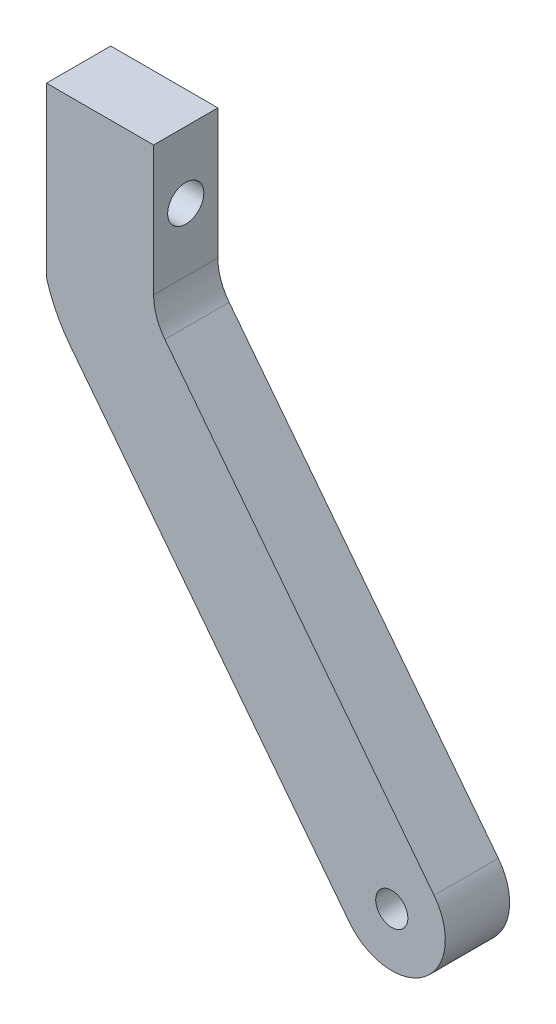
ISO-10303-21;
HEADER;
FILE_DESCRIPTION(('STEP AP214'),'2;1');
FILE_NAME('part.step','',(''),(''),'','','');
FILE_SCHEMA(('AUTOMOTIVE_DESIGN { 1 0 10303 214 1 1 1 1 }'));
ENDSEC;
DATA;
#1=APPLICATION_CONTEXT('core data for automotive mechanical design processes');
#2=APPLICATION_PROTOCOL_DEFINITION('international standard','automotive_design',2000,#1);
#3=PRODUCT_CONTEXT('',#1,'mechanical');
#4=PRODUCT('Part','Part','',(#3));
#5=PRODUCT_RELATED_PRODUCT_CATEGORY('part','',(#4));
#6=PRODUCT_DEFINITION_FORMATION('','',#4);
#7=PRODUCT_DEFINITION_CONTEXT('part definition',#1,'design');
#8=PRODUCT_DEFINITION('design','',#6,#7);
#9=PRODUCT_DEFINITION_SHAPE('','',#8);
#10=(LENGTH_UNIT() NAMED_UNIT(*) SI_UNIT(.MILLI.,.METRE.));
#11=(NAMED_UNIT(*) PLANE_ANGLE_UNIT() SI_UNIT($,.RADIAN.));
#12=(NAMED_UNIT(*) SI_UNIT($,.STERADIAN.) SOLID_ANGLE_UNIT());
#13=UNCERTAINTY_MEASURE_WITH_UNIT(LENGTH_MEASURE(1.E-05),#10,'distance_accuracy_value','');
#14=(GEOMETRIC_REPRESENTATION_CONTEXT(3) GLOBAL_UNCERTAINTY_ASSIGNED_CONTEXT((#13)) GLOBAL_UNIT_ASSIGNED_CONTEXT((#10,
#11,#12)) REPRESENTATION_CONTEXT('',''));
#15=CARTESIAN_POINT('',(0.,0.,0.));
#16=DIRECTION('',(0.,0.,1.));
#17=DIRECTION('',(1.,0.,0.));
#18=AXIS2_PLACEMENT_3D('',#15,#16,#17);
#19=CARTESIAN_POINT('',(26.2384193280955,-11.8199999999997,-6.));
#20=DIRECTION('',(0.,0.,1.));
#21=DIRECTION('',(1.,0.,0.));
#22=AXIS2_PLACEMENT_3D('',#19,#20,#21);
#23=CYLINDRICAL_SURFACE('',#22,26.2384193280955);
#24=CARTESIAN_POINT('',(26.2384193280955,-11.82,6.));
#25=DIRECTION('',(0.,0.,1.));
#26=DIRECTION('',(1.,0.,0.));
#27=AXIS2_PLACEMENT_3D('',#24,#25,#26);
#28=CIRCLE('',#27,26.2384193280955);
#29=CARTESIAN_POINT('',(1.,-18.9947361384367,5.99999999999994));
#30=VERTEX_POINT('',#29);
#31=CARTESIAN_POINT('',(5.51044309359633,-27.9074376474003,6.));
#32=VERTEX_POINT('',#31);
#33=EDGE_CURVE('E116',#30,#32,#28,.T.);
#34=ORIENTED_EDGE('',*,*,#33,.F.);
#35=DIRECTION('',(0.,0.,1.));
#36=VECTOR('',#35,1.);
#37=CARTESIAN_POINT('',(1.,-18.9947361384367,-6.00000000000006));
#38=LINE('',#37,#36);
#39=CARTESIAN_POINT('',(1.,-18.9947361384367,-6.00000000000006));
#40=VERTEX_POINT('',#39);
#41=EDGE_CURVE('E45',#40,#30,#38,.T.);
#42=ORIENTED_EDGE('',*,*,#41,.F.);
#43=CARTESIAN_POINT('',(26.2384193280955,-11.8199999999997,-6.));
#44=DIRECTION('',(0.,0.,1.));
#45=DIRECTION('',(1.,0.,0.));
#46=AXIS2_PLACEMENT_3D('',#43,#44,#45);
#47=CIRCLE('',#46,26.2384193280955);
#48=CARTESIAN_POINT('',(5.51044309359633,-27.9074376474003,-6.));
#49=VERTEX_POINT('',#48);
#50=EDGE_CURVE('E135',#40,#49,#47,.T.);
#51=ORIENTED_EDGE('',*,*,#50,.T.);
#52=DIRECTION('',(0.,0.,1.));
#53=VECTOR('',#52,1.);
#54=CARTESIAN_POINT('',(5.51044309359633,-27.9074376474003,-6.));
#55=LINE('',#54,#53);
#56=EDGE_CURVE('E144',#49,#32,#55,.T.);
#57=ORIENTED_EDGE('',*,*,#56,.T.);
#58=EDGE_LOOP('',(#34,#42,#51,#57));
#59=FACE_BOUND('',#58,.T.);
#60=ADVANCED_FACE('F28',(#59),#23,.T.);
#61=CARTESIAN_POINT('',(31.,-11.8199999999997,-6.));
#62=DIRECTION('',(0.,0.,1.));
#63=DIRECTION('',(1.,0.,0.));
#64=AXIS2_PLACEMENT_3D('',#61,#62,#63);
#65=CYLINDRICAL_SURFACE('',#64,10.);
#66=DIRECTION('',(0.,0.,1.));
#67=VECTOR('',#66,1.);
#68=CARTESIAN_POINT('',(23.100142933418,-17.9512525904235,-6.));
#69=LINE('',#68,#67);
#70=CARTESIAN_POINT('',(23.100142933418,-17.9512525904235,-6.));
#71=VERTEX_POINT('',#70);
#72=CARTESIAN_POINT('',(23.100142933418,-17.9512525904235,5.99999999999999));
#73=VERTEX_POINT('',#72);
#74=EDGE_CURVE('E11',#71,#73,#69,.T.);
#75=ORIENTED_EDGE('',*,*,#74,.F.);
#76=CARTESIAN_POINT('',(31.,-11.8199999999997,-6.));
#77=DIRECTION('',(0.,0.,1.));
#78=DIRECTION('',(1.,0.,0.));
#79=AXIS2_PLACEMENT_3D('',#76,#77,#78);
#80=CIRCLE('',#79,10.);
#81=CARTESIAN_POINT('',(21.,-11.82,-6.));
#82=VERTEX_POINT('',#81);
#83=EDGE_CURVE('E118',#82,#71,#80,.T.);
#84=ORIENTED_EDGE('',*,*,#83,.F.);
#85=DIRECTION('',(0.,0.,1.));
#86=VECTOR('',#85,1.);
#87=CARTESIAN_POINT('',(21.,-11.82,-6.));
#88=LINE('',#87,#86);
#89=CARTESIAN_POINT('',(21.,-11.82,6.));
#90=VERTEX_POINT('',#89);
#91=EDGE_CURVE('E53',#82,#90,#88,.T.);
#92=ORIENTED_EDGE('',*,*,#91,.T.);
#93=CARTESIAN_POINT('',(31.,-11.82,6.));
#94=DIRECTION('',(0.,0.,1.));
#95=DIRECTION('',(1.,0.,0.));
#96=AXIS2_PLACEMENT_3D('',#93,#94,#95);
#97=CIRCLE('',#96,10.);
#98=EDGE_CURVE('E208',#90,#73,#97,.T.);
#99=ORIENTED_EDGE('',*,*,#98,.T.);
#100=EDGE_LOOP('',(#75,#84,#92,#99));
#101=FACE_BOUND('',#100,.T.);
#102=ADVANCED_FACE('F170',(#101),#65,.F.);
#103=CARTESIAN_POINT('',(73.359857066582,-82.708747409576,-6.));
#104=DIRECTION('',(0.789985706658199,0.613125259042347,0.));
#105=DIRECTION('',(-0.613125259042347,0.789985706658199,0.));
#106=AXIS2_PLACEMENT_3D('',#103,#104,#105);
#107=PLANE('',#106);
#108=DIRECTION('',(0.,0.,1.));
#109=VECTOR('',#108,1.);
#110=CARTESIAN_POINT('',(73.359857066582,-82.708747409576,-6.));
#111=LINE('',#110,#109);
#112=CARTESIAN_POINT('',(73.359857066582,-82.708747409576,-6.));
#113=VERTEX_POINT('',#112);
#114=CARTESIAN_POINT('',(73.359857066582,-82.7087474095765,5.99999999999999));
#115=VERTEX_POINT('',#114);
#116=EDGE_CURVE('E37',#113,#115,#111,.T.);
#117=ORIENTED_EDGE('',*,*,#116,.F.);
#118=DIRECTION('',(-0.613125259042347,0.789985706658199,0.));
#119=VECTOR('',#118,1.);
#120=CARTESIAN_POINT('',(73.359857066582,-82.708747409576,-6.));
#121=LINE('',#120,#119);
#122=EDGE_CURVE('E126',#113,#71,#121,.T.);
#123=ORIENTED_EDGE('',*,*,#122,.T.);
#124=ORIENTED_EDGE('',*,*,#74,.T.);
#125=DIRECTION('',(-0.613125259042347,0.789985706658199,0.));
#126=VECTOR('',#125,1.);
#127=CARTESIAN_POINT('',(73.359857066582,-82.7087474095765,5.99999999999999));
#128=LINE('',#127,#126);
#129=EDGE_CURVE('E211',#115,#73,#128,.T.);
#130=ORIENTED_EDGE('',*,*,#129,.F.);
#131=EDGE_LOOP('',(#117,#123,#124,#130));
#132=FACE_BOUND('',#131,.T.);
#133=ADVANCED_FACE('F30',(#132),#107,.T.);
#134=CARTESIAN_POINT('',(65.46,-88.84,-6.));
#135=DIRECTION('',(0.,0.,1.));
#136=DIRECTION('',(1.,0.,0.));
#137=AXIS2_PLACEMENT_3D('',#134,#135,#136);
#138=CYLINDRICAL_SURFACE('',#137,10.);
#139=DIRECTION('',(0.,0.,1.));
#140=VECTOR('',#139,1.);
#141=CARTESIAN_POINT('',(57.560142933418,-94.9712525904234,-6.00000000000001));
#142=LINE('',#141,#140);
#143=CARTESIAN_POINT('',(57.560142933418,-94.9712525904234,-6.00000000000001));
#144=VERTEX_POINT('',#143);
#145=CARTESIAN_POINT('',(57.560142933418,-94.9712525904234,6.));
#146=VERTEX_POINT('',#145);
#147=EDGE_CURVE('E147',#144,#146,#142,.T.);
#148=ORIENTED_EDGE('',*,*,#147,.F.);
#149=CARTESIAN_POINT('',(65.46,-88.84,-6.));
#150=DIRECTION('',(0.,0.,1.));
#151=DIRECTION('',(1.,0.,0.));
#152=AXIS2_PLACEMENT_3D('',#149,#150,#151);
#153=CIRCLE('',#152,10.);
#154=EDGE_CURVE('E129',#144,#113,#153,.T.);
#155=ORIENTED_EDGE('',*,*,#154,.T.);
#156=ORIENTED_EDGE('',*,*,#116,.T.);
#157=CARTESIAN_POINT('',(65.46,-88.84,6.));
#158=DIRECTION('',(0.,0.,1.));
#159=DIRECTION('',(1.,0.,0.));
#160=AXIS2_PLACEMENT_3D('',#157,#158,#159);
#161=CIRCLE('',#160,10.);
#162=EDGE_CURVE('E194',#146,#115,#161,.T.);
#163=ORIENTED_EDGE('',*,*,#162,.F.);
#164=EDGE_LOOP('',(#148,#155,#156,#163));
#165=FACE_BOUND('',#164,.T.);
#166=ADVANCED_FACE('F183',(#165),#138,.T.);
#167=CARTESIAN_POINT('',(57.560142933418,-94.9712525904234,-6.00000000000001));
#168=DIRECTION('',(0.7899857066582,0.613125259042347,0.));
#169=DIRECTION('',(-0.613125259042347,0.7899857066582,0.));
#170=AXIS2_PLACEMENT_3D('',#167,#168,#169);
#171=PLANE('',#170);
#172=ORIENTED_EDGE('',*,*,#56,.F.);
#173=DIRECTION('',(-0.613125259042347,0.7899857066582,0.));
#174=VECTOR('',#173,1.);
#175=CARTESIAN_POINT('',(57.560142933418,-94.9712525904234,-6.00000000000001));
#176=LINE('',#175,#174);
#177=EDGE_CURVE('E132',#144,#49,#176,.T.);
#178=ORIENTED_EDGE('',*,*,#177,.F.);
#179=ORIENTED_EDGE('',*,*,#147,.T.);
#180=DIRECTION('',(-0.613125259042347,0.7899857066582,0.));
#181=VECTOR('',#180,1.);
#182=CARTESIAN_POINT('',(57.560142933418,-94.9712525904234,6.));
#183=LINE('',#182,#181);
#184=EDGE_CURVE('E120',#146,#32,#183,.T.);
#185=ORIENTED_EDGE('',*,*,#184,.T.);
#186=EDGE_LOOP('',(#172,#178,#179,#185));
#187=FACE_BOUND('',#186,.T.);
#188=ADVANCED_FACE('F181',(#187),#171,.F.);
#189=CARTESIAN_POINT('',(0.,12.4300000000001,-6.));
#190=DIRECTION('',(0.,-1.,0.));
#191=DIRECTION('',(1.,0.,0.));
#192=AXIS2_PLACEMENT_3D('',#189,#190,#191);
#193=PLANE('',#192);
#194=DIRECTION('',(1.,0.,0.));
#195=VECTOR('',#194,1.);
#196=CARTESIAN_POINT('',(0.,12.4300000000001,-6.));
#197=LINE('',#196,#195);
#198=CARTESIAN_POINT('',(1.,12.4300000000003,-6.));
#199=VERTEX_POINT('',#198);
#200=CARTESIAN_POINT('',(21.,12.4300000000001,-6.));
#201=VERTEX_POINT('',#200);
#202=EDGE_CURVE('E109',#199,#201,#197,.T.);
#203=ORIENTED_EDGE('',*,*,#202,.F.);
#204=DIRECTION('',(0.,0.,1.));
#205=VECTOR('',#204,1.);
#206=CARTESIAN_POINT('',(1.,12.4300000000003,-6.));
#207=LINE('',#206,#205);
#208=CARTESIAN_POINT('',(1.,12.4300000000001,6.));
#209=VERTEX_POINT('',#208);
#210=EDGE_CURVE('E96',#199,#209,#207,.T.);
#211=ORIENTED_EDGE('',*,*,#210,.T.);
#212=DIRECTION('',(1.,0.,0.));
#213=VECTOR('',#212,1.);
#214=CARTESIAN_POINT('',(0.,12.4300000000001,6.));
#215=LINE('',#214,#213);
#216=CARTESIAN_POINT('',(21.,12.4300000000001,6.));
#217=VERTEX_POINT('',#216);
#218=EDGE_CURVE('E107',#209,#217,#215,.T.);
#219=ORIENTED_EDGE('',*,*,#218,.T.);
#220=DIRECTION('',(0.,0.,1.));
#221=VECTOR('',#220,1.);
#222=CARTESIAN_POINT('',(21.,12.4300000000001,-6.));
#223=LINE('',#222,#221);
#224=EDGE_CURVE('E142',#201,#217,#223,.T.);
#225=ORIENTED_EDGE('',*,*,#224,.F.);
#226=EDGE_LOOP('',(#203,#211,#219,#225));
#227=FACE_BOUND('',#226,.T.);
#228=ADVANCED_FACE('F105',(#227),#193,.F.);
#229=CARTESIAN_POINT('',(21.,12.4300000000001,-6.));
#230=DIRECTION('',(-1.,0.,0.));
#231=DIRECTION('',(0.,0.,1.));
#232=AXIS2_PLACEMENT_3D('',#229,#230,#231);
#233=PLANE('',#232);
#234=CARTESIAN_POINT('',(21.,2.63677968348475E-13,0.));
#235=DIRECTION('',(-1.,0.,0.));
#236=DIRECTION('',(0.,0.,1.));
#237=AXIS2_PLACEMENT_3D('',#234,#235,#236);
#238=CIRCLE('',#237,3.375);
#239=CARTESIAN_POINT('',(21.,2.63677968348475E-13,3.375));
#240=VERTEX_POINT('',#239);
#241=EDGE_CURVE('E149',#240,#240,#238,.T.);
#242=ORIENTED_EDGE('',*,*,#241,.T.);
#243=EDGE_LOOP('',(#242));
#244=FACE_BOUND('',#243,.T.);
#245=DIRECTION('',(0.,-1.,0.));
#246=VECTOR('',#245,1.);
#247=CARTESIAN_POINT('',(21.,12.4300000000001,-6.));
#248=LINE('',#247,#246);
#249=EDGE_CURVE('E138',#201,#82,#248,.T.);
#250=ORIENTED_EDGE('',*,*,#249,.F.);
#251=ORIENTED_EDGE('',*,*,#224,.T.);
#252=DIRECTION('',(0.,-1.,0.));
#253=VECTOR('',#252,1.);
#254=CARTESIAN_POINT('',(21.,12.4300000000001,6.));
#255=LINE('',#254,#253);
#256=EDGE_CURVE('E115',#217,#90,#255,.T.);
#257=ORIENTED_EDGE('',*,*,#256,.T.);
#258=ORIENTED_EDGE('',*,*,#91,.F.);
#259=EDGE_LOOP('',(#250,#251,#257,#258));
#260=FACE_BOUND('',#259,.T.);
#261=ADVANCED_FACE('F215',(#244,#260),#233,.F.);
#262=CARTESIAN_POINT('',(31.,-11.8199999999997,-6.));
#263=DIRECTION('',(0.,0.,1.));
#264=DIRECTION('',(1.,0.,0.));
#265=AXIS2_PLACEMENT_3D('',#262,#263,#264);
#266=PLANE('',#265);
#267=CARTESIAN_POINT('',(65.46,-88.84,-6.));
#268=DIRECTION('',(0.,0.,1.));
#269=DIRECTION('',(1.,0.,0.));
#270=AXIS2_PLACEMENT_3D('',#267,#268,#269);
#271=CIRCLE('',#270,3.00000000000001);
#272=CARTESIAN_POINT('',(68.46,-88.84,-6.));
#273=VERTEX_POINT('',#272);
#274=EDGE_CURVE('E155',#273,#273,#271,.T.);
#275=ORIENTED_EDGE('',*,*,#274,.T.);
#276=EDGE_LOOP('',(#275));
#277=FACE_BOUND('',#276,.T.);
#278=ORIENTED_EDGE('',*,*,#50,.F.);
#279=DIRECTION('',(0.,1.,0.));
#280=VECTOR('',#279,1.);
#281=CARTESIAN_POINT('',(1.,-18.9947361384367,-6.00000000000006));
#282=LINE('',#281,#280);
#283=EDGE_CURVE('E101',#40,#199,#282,.T.);
#284=ORIENTED_EDGE('',*,*,#283,.T.);
#285=ORIENTED_EDGE('',*,*,#202,.T.);
#286=ORIENTED_EDGE('',*,*,#249,.T.);
#287=ORIENTED_EDGE('',*,*,#83,.T.);
#288=ORIENTED_EDGE('',*,*,#122,.F.);
#289=ORIENTED_EDGE('',*,*,#154,.F.);
#290=ORIENTED_EDGE('',*,*,#177,.T.);
#291=EDGE_LOOP('',(#278,#284,#285,#286,#287,#288,#289,#290));
#292=FACE_BOUND('',#291,.T.);
#293=ADVANCED_FACE('F201',(#277,#292),#266,.F.);
#294=CARTESIAN_POINT('',(31.,-11.82,6.));
#295=DIRECTION('',(0.,0.,1.));
#296=DIRECTION('',(1.,0.,0.));
#297=AXIS2_PLACEMENT_3D('',#294,#295,#296);
#298=PLANE('',#297);
#299=DIRECTION('',(0.,1.,0.));
#300=VECTOR('',#299,1.);
#301=CARTESIAN_POINT('',(1.,-18.9947361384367,5.99999999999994));
#302=LINE('',#301,#300);
#303=EDGE_CURVE('E92',#30,#209,#302,.T.);
#304=ORIENTED_EDGE('',*,*,#303,.F.);
#305=ORIENTED_EDGE('',*,*,#33,.T.);
#306=ORIENTED_EDGE('',*,*,#184,.F.);
#307=ORIENTED_EDGE('',*,*,#162,.T.);
#308=ORIENTED_EDGE('',*,*,#129,.T.);
#309=ORIENTED_EDGE('',*,*,#98,.F.);
#310=ORIENTED_EDGE('',*,*,#256,.F.);
#311=ORIENTED_EDGE('',*,*,#218,.F.);
#312=EDGE_LOOP('',(#304,#305,#306,#307,#308,#309,#310,#311));
#313=FACE_BOUND('',#312,.T.);
#314=CARTESIAN_POINT('',(65.46,-88.84,6.));
#315=DIRECTION('',(0.,0.,1.));
#316=DIRECTION('',(1.,0.,0.));
#317=AXIS2_PLACEMENT_3D('',#314,#315,#316);
#318=CIRCLE('',#317,3.00000000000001);
#319=CARTESIAN_POINT('',(68.46,-88.84,6.));
#320=VERTEX_POINT('',#319);
#321=EDGE_CURVE('E151',#320,#320,#318,.T.);
#322=ORIENTED_EDGE('',*,*,#321,.F.);
#323=EDGE_LOOP('',(#322));
#324=FACE_BOUND('',#323,.T.);
#325=ADVANCED_FACE('F112',(#313,#324),#298,.T.);
#326=CARTESIAN_POINT('',(65.46,-88.84,-6.));
#327=DIRECTION('',(0.,0.,1.));
#328=DIRECTION('',(1.,0.,0.));
#329=AXIS2_PLACEMENT_3D('',#326,#327,#328);
#330=CYLINDRICAL_SURFACE('',#329,3.00000000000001);
#331=ORIENTED_EDGE('',*,*,#274,.F.);
#332=EDGE_LOOP('',(#331));
#333=FACE_BOUND('',#332,.T.);
#334=ORIENTED_EDGE('',*,*,#321,.T.);
#335=EDGE_LOOP('',(#334));
#336=FACE_BOUND('',#335,.T.);
#337=ADVANCED_FACE('F167',(#333,#336),#330,.F.);
#338=CARTESIAN_POINT('',(75.46,0.,0.));
#339=DIRECTION('',(-1.,0.,0.));
#340=DIRECTION('',(0.,-1.,0.));
#341=AXIS2_PLACEMENT_3D('',#338,#339,#340);
#342=CYLINDRICAL_SURFACE('',#341,3.375);
#343=CARTESIAN_POINT('',(1.,2.63677968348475E-13,0.));
#344=DIRECTION('',(1.,0.,0.));
#345=DIRECTION('',(0.,0.,-1.));
#346=AXIS2_PLACEMENT_3D('',#343,#344,#345);
#347=CIRCLE('',#346,3.375);
#348=CARTESIAN_POINT('',(1.,2.63677968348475E-13,-3.375));
#349=VERTEX_POINT('',#348);
#350=EDGE_CURVE('E32',#349,#349,#347,.F.);
#351=ORIENTED_EDGE('',*,*,#350,.T.);
#352=EDGE_LOOP('',(#351));
#353=FACE_BOUND('',#352,.T.);
#354=ORIENTED_EDGE('',*,*,#241,.F.);
#355=EDGE_LOOP('',(#354));
#356=FACE_BOUND('',#355,.T.);
#357=ADVANCED_FACE('F160',(#353,#356),#342,.F.);
#358=CARTESIAN_POINT('',(1.,-18.9947361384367,-6.00000000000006));
#359=DIRECTION('',(1.,0.,0.));
#360=DIRECTION('',(0.,0.,-1.));
#361=AXIS2_PLACEMENT_3D('',#358,#359,#360);
#362=PLANE('',#361);
#363=ORIENTED_EDGE('',*,*,#41,.T.);
#364=ORIENTED_EDGE('',*,*,#303,.T.);
#365=ORIENTED_EDGE('',*,*,#210,.F.);
#366=ORIENTED_EDGE('',*,*,#283,.F.);
#367=EDGE_LOOP('',(#363,#364,#365,#366));
#368=FACE_BOUND('',#367,.T.);
#369=ORIENTED_EDGE('',*,*,#350,.F.);
#370=EDGE_LOOP('',(#369));
#371=FACE_BOUND('',#370,.T.);
#372=ADVANCED_FACE('F94',(#368,#371),#362,.F.);
#373=CLOSED_SHELL('',(#60,#102,#133,#166,#188,#228,#261,#293,#325,#337,#357,#372));
#374=MANIFOLD_SOLID_BREP('B2',#373);
#375=ADVANCED_BREP_SHAPE_REPRESENTATION('',(#18,#374),#14);
#376=SHAPE_DEFINITION_REPRESENTATION(#9,#375);
ENDSEC;
END-ISO-10303-21;
